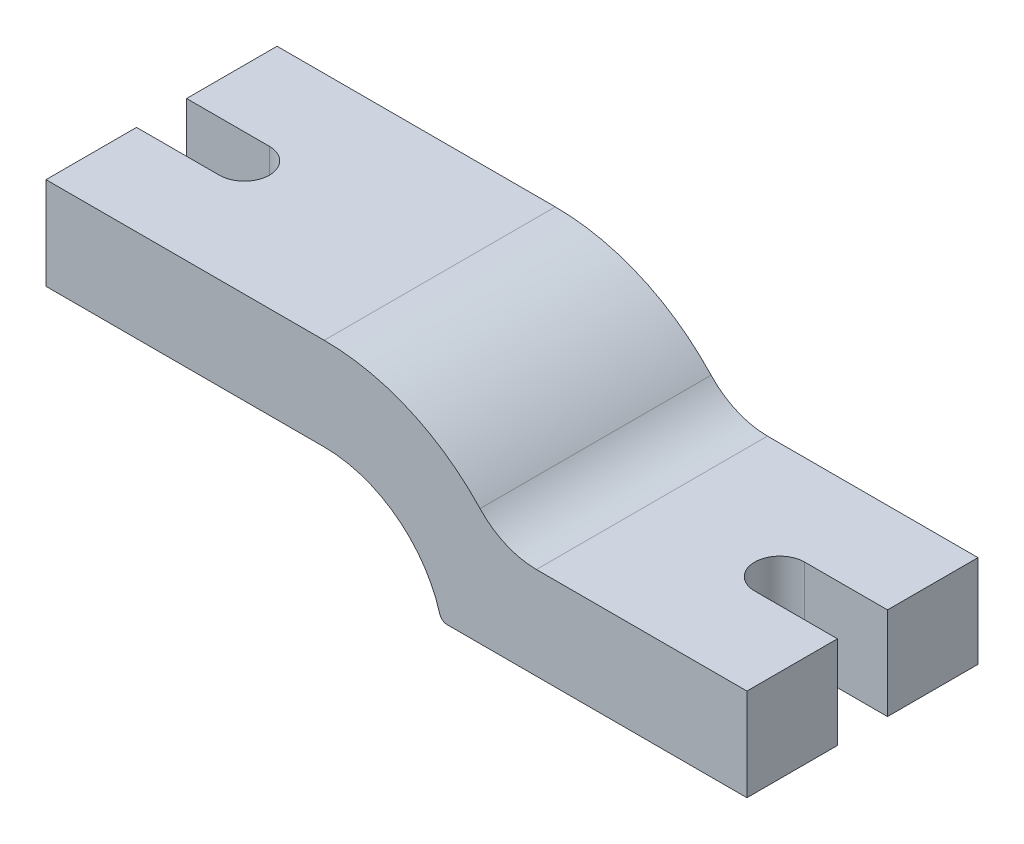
from build123d import *

# Parameters (mm, degrees)
BOSS_EXTRU_1_DEPTH      = 30
CONG_1_R                = 10
CONG_2_R                = 1
ENL_V_MAT_EXTRU_1_DEPTH = 67.990073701


with BuildPart() as part:
    # Esquisse1 → Boss.-Extru.1 (new body)
    with BuildSketch(Plane.XY):
        with BuildLine():
            Line((0, 15.625), (-36.12, 15.625))
            Line((-36.12, 15.625), (-36.12, 27.625))
            Line((-36.12, 27.625), (0, 27.625))
            ThreePointArc((0, 27.625), (12.87439319, 24.441575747), (22.7815715, 15.625))
            Line((22.7815715, 15.625), (54.878684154, 15.625))
            Line((54.878684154, 15.625), (54.878684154, 3.625))
            Line((54.878684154, 3.625), (15.198684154, 3.625))
            ThreePointArc((15.198684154, 3.625), (9.682458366, 12.263385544), (0, 15.625))
        make_face()
    extrude(amount=BOSS_EXTRU_1_DEPTH)

    # Cong_1
    cong_1_edges = [part.edges().sort_by_distance(p)[0] for p in [
        (22.7815715, 15.625, 15),
    ]]
    fillet(cong_1_edges, radius=CONG_1_R)

    # Cong_2
    cong_2_edges = [part.edges().sort_by_distance(p)[0] for p in [
        (15.198684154, 3.625, 15),
    ]]
    fillet(cong_2_edges, radius=CONG_2_R)

    # Esquisse2 → Enl_v. mat.-Extru.1 (cut, through all)
    with BuildSketch(Plane(origin=(0, 27.625, 0), x_dir=(1, 0, 0), z_dir=(0, 1, 0))):
        with BuildLine():
            Line((-36.12, -11.75), (-25.37, -11.75))
            ThreePointArc((-25.37, -11.75), (-22.12, -15), (-25.37, -18.25))
            Line((-25.37, -18.25), (-36.12, -18.25))
            ThreePointArc((-36.12, -18.25), (-39.37, -15), (-36.12, -11.75))
        make_face()
        with BuildLine():
            Line((54.878684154, -18.25), (44.128684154, -18.25))
            ThreePointArc((44.128684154, -18.25), (40.878684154, -15), (44.128684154, -11.75))
            Line((44.128684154, -11.75), (54.878684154, -11.75))
            ThreePointArc((54.878684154, -11.75), (58.128684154, -15), (54.878684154, -18.25))
        make_face()
    extrude(amount=-ENL_V_MAT_EXTRU_1_DEPTH, mode=Mode.SUBTRACT)


solid = part.part
